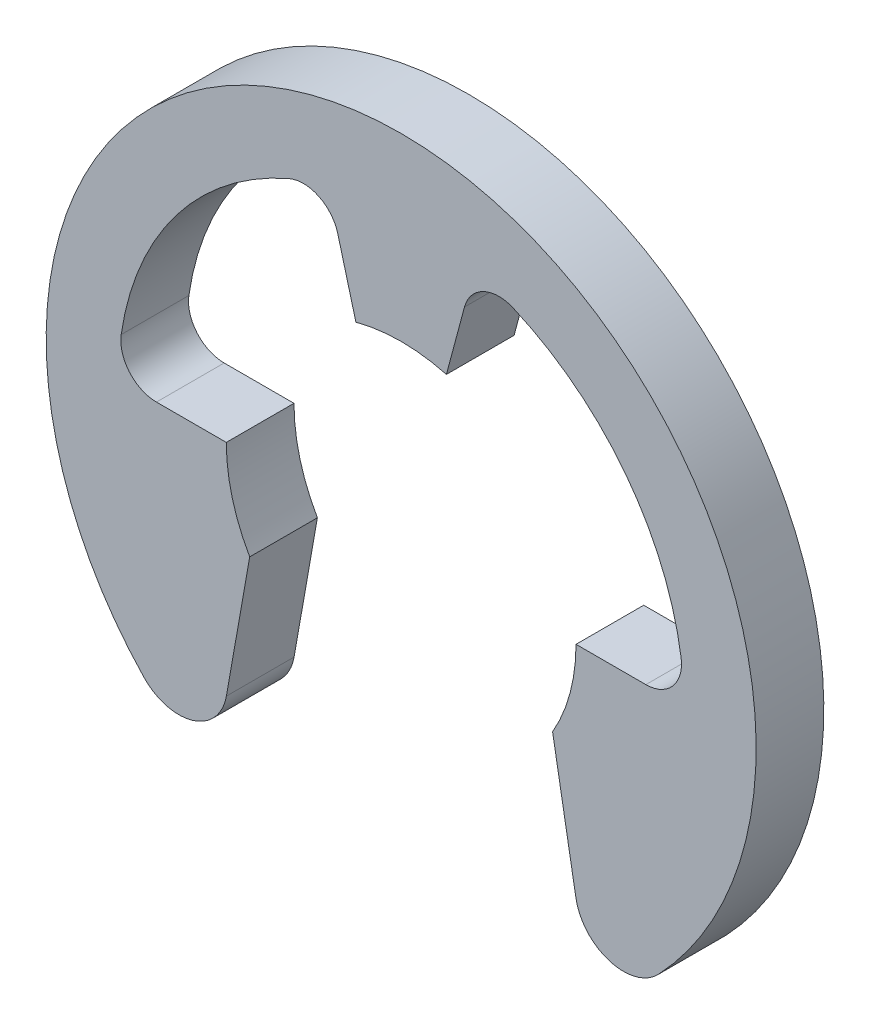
ISO-10303-21;
HEADER;
FILE_DESCRIPTION(('STEP AP214'),'2;1');
FILE_NAME('part.step','',(''),(''),'','','');
FILE_SCHEMA(('AUTOMOTIVE_DESIGN { 1 0 10303 214 1 1 1 1 }'));
ENDSEC;
DATA;
#1=APPLICATION_CONTEXT('core data for automotive mechanical design processes');
#2=APPLICATION_PROTOCOL_DEFINITION('international standard','automotive_design',2000,#1);
#3=PRODUCT_CONTEXT('',#1,'mechanical');
#4=PRODUCT('Part','Part','',(#3));
#5=PRODUCT_RELATED_PRODUCT_CATEGORY('part','',(#4));
#6=PRODUCT_DEFINITION_FORMATION('','',#4);
#7=PRODUCT_DEFINITION_CONTEXT('part definition',#1,'design');
#8=PRODUCT_DEFINITION('design','',#6,#7);
#9=PRODUCT_DEFINITION_SHAPE('','',#8);
#10=(LENGTH_UNIT() NAMED_UNIT(*) SI_UNIT(.MILLI.,.METRE.));
#11=(NAMED_UNIT(*) PLANE_ANGLE_UNIT() SI_UNIT($,.RADIAN.));
#12=(NAMED_UNIT(*) SI_UNIT($,.STERADIAN.) SOLID_ANGLE_UNIT());
#13=UNCERTAINTY_MEASURE_WITH_UNIT(LENGTH_MEASURE(1.E-05),#10,'distance_accuracy_value','');
#14=(GEOMETRIC_REPRESENTATION_CONTEXT(3) GLOBAL_UNCERTAINTY_ASSIGNED_CONTEXT((#13)) GLOBAL_UNIT_ASSIGNED_CONTEXT((#10,
#11,#12)) REPRESENTATION_CONTEXT('',''));
#15=CARTESIAN_POINT('',(0.,0.,0.));
#16=DIRECTION('',(0.,0.,1.));
#17=DIRECTION('',(1.,0.,0.));
#18=AXIS2_PLACEMENT_3D('',#15,#16,#17);
#19=CARTESIAN_POINT('',(2.16887826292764,0.316106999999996,-0.6));
#20=DIRECTION('',(0.,0.,1.));
#21=DIRECTION('',(1.,0.,0.));
#22=AXIS2_PLACEMENT_3D('',#19,#20,#21);
#23=CYLINDRICAL_SURFACE('',#22,0.316107);
#24=CARTESIAN_POINT('',(2.16887826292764,0.316106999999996,0.));
#25=DIRECTION('',(0.,0.,-1.));
#26=DIRECTION('',(1.,0.,0.));
#27=AXIS2_PLACEMENT_3D('',#24,#25,#26);
#28=CIRCLE('',#27,0.316107);
#29=CARTESIAN_POINT('',(2.48168043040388,0.361696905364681,0.));
#30=VERTEX_POINT('',#29);
#31=CARTESIAN_POINT('',(2.16887826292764,0.,0.));
#32=VERTEX_POINT('',#31);
#33=EDGE_CURVE('E157',#30,#32,#28,.T.);
#34=ORIENTED_EDGE('',*,*,#33,.F.);
#35=DIRECTION('',(0.,0.,1.));
#36=VECTOR('',#35,1.);
#37=CARTESIAN_POINT('',(2.48168043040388,0.361696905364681,-0.6));
#38=LINE('',#37,#36);
#39=CARTESIAN_POINT('',(2.48168043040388,0.361696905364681,-0.6));
#40=VERTEX_POINT('',#39);
#41=EDGE_CURVE('E11',#40,#30,#38,.T.);
#42=ORIENTED_EDGE('',*,*,#41,.F.);
#43=CARTESIAN_POINT('',(2.16887826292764,0.316106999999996,-0.6));
#44=DIRECTION('',(0.,0.,-1.));
#45=DIRECTION('',(1.,0.,0.));
#46=AXIS2_PLACEMENT_3D('',#43,#44,#45);
#47=CIRCLE('',#46,0.316107);
#48=CARTESIAN_POINT('',(2.16887826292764,0.,-0.6));
#49=VERTEX_POINT('',#48);
#50=EDGE_CURVE('E159',#40,#49,#47,.T.);
#51=ORIENTED_EDGE('',*,*,#50,.T.);
#52=DIRECTION('',(0.,0.,1.));
#53=VECTOR('',#52,1.);
#54=CARTESIAN_POINT('',(2.16887826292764,0.,-0.6));
#55=LINE('',#54,#53);
#56=EDGE_CURVE('E36',#49,#32,#55,.T.);
#57=ORIENTED_EDGE('',*,*,#56,.T.);
#58=EDGE_LOOP('',(#34,#42,#51,#57));
#59=FACE_BOUND('',#58,.T.);
#60=ADVANCED_FACE('F33',(#59),#23,.F.);
#61=CARTESIAN_POINT('',(0.,0.,-0.6));
#62=DIRECTION('',(0.,0.,1.));
#63=DIRECTION('',(1.,0.,0.));
#64=AXIS2_PLACEMENT_3D('',#61,#62,#63);
#65=CYLINDRICAL_SURFACE('',#64,2.5079);
#66=CARTESIAN_POINT('',(0.,0.,0.));
#67=DIRECTION('',(0.,0.,-1.));
#68=DIRECTION('',(1.,0.,0.));
#69=AXIS2_PLACEMENT_3D('',#66,#67,#68);
#70=CIRCLE('',#69,2.5079);
#71=CARTESIAN_POINT('',(0.991678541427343,2.30350517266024,0.));
#72=VERTEX_POINT('',#71);
#73=EDGE_CURVE('E175',#72,#30,#70,.T.);
#74=ORIENTED_EDGE('',*,*,#73,.F.);
#75=DIRECTION('',(0.,0.,1.));
#76=VECTOR('',#75,1.);
#77=CARTESIAN_POINT('',(0.991678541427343,2.30350517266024,-0.600000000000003));
#78=LINE('',#77,#76);
#79=CARTESIAN_POINT('',(0.991678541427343,2.30350517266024,-0.600000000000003));
#80=VERTEX_POINT('',#79);
#81=EDGE_CURVE('E41',#80,#72,#78,.T.);
#82=ORIENTED_EDGE('',*,*,#81,.F.);
#83=CARTESIAN_POINT('',(0.,0.,-0.6));
#84=DIRECTION('',(0.,0.,-1.));
#85=DIRECTION('',(1.,0.,0.));
#86=AXIS2_PLACEMENT_3D('',#83,#84,#85);
#87=CIRCLE('',#86,2.5079);
#88=EDGE_CURVE('E164',#80,#40,#87,.T.);
#89=ORIENTED_EDGE('',*,*,#88,.T.);
#90=ORIENTED_EDGE('',*,*,#41,.T.);
#91=EDGE_LOOP('',(#74,#82,#89,#90));
#92=FACE_BOUND('',#91,.T.);
#93=ADVANCED_FACE('F354',(#92),#65,.F.);
#94=CARTESIAN_POINT('',(0.866682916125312,2.01316101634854,-0.600000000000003));
#95=DIRECTION('',(0.,0.,1.));
#96=DIRECTION('',(1.,0.,0.));
#97=AXIS2_PLACEMENT_3D('',#94,#95,#96);
#98=CYLINDRICAL_SURFACE('',#97,0.316107);
#99=CARTESIAN_POINT('',(0.866682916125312,2.01316101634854,0.));
#100=DIRECTION('',(0.,0.,-1.));
#101=DIRECTION('',(1.,0.,0.));
#102=AXIS2_PLACEMENT_3D('',#99,#100,#101);
#103=CIRCLE('',#102,0.316107);
#104=CARTESIAN_POINT('',(0.561347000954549,2.09497552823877,0.));
#105=VERTEX_POINT('',#104);
#106=EDGE_CURVE('E218',#105,#72,#103,.T.);
#107=ORIENTED_EDGE('',*,*,#106,.F.);
#108=DIRECTION('',(0.,0.,1.));
#109=VECTOR('',#108,1.);
#110=CARTESIAN_POINT('',(0.561347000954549,2.09497552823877,-0.600000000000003));
#111=LINE('',#110,#109);
#112=CARTESIAN_POINT('',(0.561347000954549,2.09497552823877,-0.600000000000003));
#113=VERTEX_POINT('',#112);
#114=EDGE_CURVE('E270',#113,#105,#111,.T.);
#115=ORIENTED_EDGE('',*,*,#114,.F.);
#116=CARTESIAN_POINT('',(0.866682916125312,2.01316101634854,-0.600000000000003));
#117=DIRECTION('',(0.,0.,-1.));
#118=DIRECTION('',(1.,0.,0.));
#119=AXIS2_PLACEMENT_3D('',#116,#117,#118);
#120=CIRCLE('',#119,0.316107);
#121=EDGE_CURVE('E266',#113,#80,#120,.T.);
#122=ORIENTED_EDGE('',*,*,#121,.T.);
#123=ORIENTED_EDGE('',*,*,#81,.T.);
#124=EDGE_LOOP('',(#107,#115,#122,#123));
#125=FACE_BOUND('',#124,.T.);
#126=ADVANCED_FACE('F359',(#125),#98,.F.);
#127=CARTESIAN_POINT('',(0.401169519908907,1.49718503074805,-0.6));
#128=DIRECTION('',(0.965925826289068,-0.258819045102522,0.));
#129=DIRECTION('',(0.258819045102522,0.965925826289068,0.));
#130=AXIS2_PLACEMENT_3D('',#127,#128,#129);
#131=PLANE('',#130);
#132=DIRECTION('',(0.258819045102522,0.965925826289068,0.));
#133=VECTOR('',#132,1.);
#134=CARTESIAN_POINT('',(0.401169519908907,1.49718503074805,0.));
#135=LINE('',#134,#133);
#136=CARTESIAN_POINT('',(0.401169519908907,1.49718503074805,0.));
#137=VERTEX_POINT('',#136);
#138=EDGE_CURVE('E215',#137,#105,#135,.T.);
#139=ORIENTED_EDGE('',*,*,#138,.F.);
#140=DIRECTION('',(0.,0.,1.));
#141=VECTOR('',#140,1.);
#142=CARTESIAN_POINT('',(0.401169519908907,1.49718503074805,-0.6));
#143=LINE('',#142,#141);
#144=CARTESIAN_POINT('',(0.401169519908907,1.49718503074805,-0.6));
#145=VERTEX_POINT('',#144);
#146=EDGE_CURVE('E272',#145,#137,#143,.T.);
#147=ORIENTED_EDGE('',*,*,#146,.F.);
#148=DIRECTION('',(0.258819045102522,0.965925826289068,0.));
#149=VECTOR('',#148,1.);
#150=CARTESIAN_POINT('',(0.401169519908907,1.49718503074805,-0.6));
#151=LINE('',#150,#149);
#152=EDGE_CURVE('E263',#145,#113,#151,.T.);
#153=ORIENTED_EDGE('',*,*,#152,.T.);
#154=ORIENTED_EDGE('',*,*,#114,.T.);
#155=EDGE_LOOP('',(#139,#147,#153,#154));
#156=FACE_BOUND('',#155,.T.);
#157=ADVANCED_FACE('F351',(#156),#131,.T.);
#158=CARTESIAN_POINT('',(0.,0.,-0.6));
#159=DIRECTION('',(0.,0.,1.));
#160=DIRECTION('',(1.,0.,0.));
#161=AXIS2_PLACEMENT_3D('',#158,#159,#160);
#162=CYLINDRICAL_SURFACE('',#161,1.55);
#163=CARTESIAN_POINT('',(0.,0.,0.));
#164=DIRECTION('',(0.,0.,-1.));
#165=DIRECTION('',(-1.,0.,0.));
#166=AXIS2_PLACEMENT_3D('',#163,#164,#165);
#167=CIRCLE('',#166,1.55);
#168=CARTESIAN_POINT('',(-0.401169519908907,1.49718503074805,0.));
#169=VERTEX_POINT('',#168);
#170=EDGE_CURVE('E212',#169,#137,#167,.T.);
#171=ORIENTED_EDGE('',*,*,#170,.F.);
#172=DIRECTION('',(0.,0.,1.));
#173=VECTOR('',#172,1.);
#174=CARTESIAN_POINT('',(-0.401169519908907,1.49718503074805,-0.6));
#175=LINE('',#174,#173);
#176=CARTESIAN_POINT('',(-0.401169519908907,1.49718503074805,-0.6));
#177=VERTEX_POINT('',#176);
#178=EDGE_CURVE('E274',#177,#169,#175,.T.);
#179=ORIENTED_EDGE('',*,*,#178,.F.);
#180=CARTESIAN_POINT('',(0.,0.,-0.6));
#181=DIRECTION('',(0.,0.,-1.));
#182=DIRECTION('',(-1.,0.,0.));
#183=AXIS2_PLACEMENT_3D('',#180,#181,#182);
#184=CIRCLE('',#183,1.55);
#185=EDGE_CURVE('E260',#177,#145,#184,.T.);
#186=ORIENTED_EDGE('',*,*,#185,.T.);
#187=ORIENTED_EDGE('',*,*,#146,.T.);
#188=EDGE_LOOP('',(#171,#179,#186,#187));
#189=FACE_BOUND('',#188,.T.);
#190=ADVANCED_FACE('F347',(#189),#162,.F.);
#191=CARTESIAN_POINT('',(-0.401169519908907,1.49718503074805,-0.6));
#192=DIRECTION('',(-0.965925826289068,-0.258819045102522,0.));
#193=DIRECTION('',(0.258819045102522,-0.965925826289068,0.));
#194=AXIS2_PLACEMENT_3D('',#191,#192,#193);
#195=PLANE('',#194);
#196=DIRECTION('',(0.258819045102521,-0.965925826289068,0.));
#197=VECTOR('',#196,1.);
#198=CARTESIAN_POINT('',(-0.401169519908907,1.49718503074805,0.));
#199=LINE('',#198,#197);
#200=CARTESIAN_POINT('',(-0.561347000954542,2.09497552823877,0.));
#201=VERTEX_POINT('',#200);
#202=EDGE_CURVE('E209',#201,#169,#199,.T.);
#203=ORIENTED_EDGE('',*,*,#202,.F.);
#204=DIRECTION('',(0.,0.,1.));
#205=VECTOR('',#204,1.);
#206=CARTESIAN_POINT('',(-0.561347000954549,2.09497552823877,-0.600000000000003));
#207=LINE('',#206,#205);
#208=CARTESIAN_POINT('',(-0.561347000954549,2.09497552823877,-0.600000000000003));
#209=VERTEX_POINT('',#208);
#210=EDGE_CURVE('E276',#209,#201,#207,.T.);
#211=ORIENTED_EDGE('',*,*,#210,.F.);
#212=DIRECTION('',(0.258819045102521,-0.965925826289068,0.));
#213=VECTOR('',#212,1.);
#214=CARTESIAN_POINT('',(-0.401169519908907,1.49718503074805,-0.6));
#215=LINE('',#214,#213);
#216=EDGE_CURVE('E257',#209,#177,#215,.T.);
#217=ORIENTED_EDGE('',*,*,#216,.T.);
#218=ORIENTED_EDGE('',*,*,#178,.T.);
#219=EDGE_LOOP('',(#203,#211,#217,#218));
#220=FACE_BOUND('',#219,.T.);
#221=ADVANCED_FACE('F343',(#220),#195,.T.);
#222=CARTESIAN_POINT('',(-0.866682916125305,2.01316101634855,-0.600000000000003));
#223=DIRECTION('',(0.,0.,1.));
#224=DIRECTION('',(1.,0.,0.));
#225=AXIS2_PLACEMENT_3D('',#222,#223,#224);
#226=CYLINDRICAL_SURFACE('',#225,0.316107);
#227=CARTESIAN_POINT('',(-0.866682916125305,2.01316101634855,0.));
#228=DIRECTION('',(0.,0.,-1.));
#229=DIRECTION('',(1.,0.,0.));
#230=AXIS2_PLACEMENT_3D('',#227,#228,#229);
#231=CIRCLE('',#230,0.316107);
#232=CARTESIAN_POINT('',(-0.991678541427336,2.30350517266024,0.));
#233=VERTEX_POINT('',#232);
#234=EDGE_CURVE('E206',#233,#201,#231,.T.);
#235=ORIENTED_EDGE('',*,*,#234,.F.);
#236=DIRECTION('',(0.,0.,1.));
#237=VECTOR('',#236,1.);
#238=CARTESIAN_POINT('',(-0.991678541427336,2.30350517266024,-0.6));
#239=LINE('',#238,#237);
#240=CARTESIAN_POINT('',(-0.991678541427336,2.30350517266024,-0.6));
#241=VERTEX_POINT('',#240);
#242=EDGE_CURVE('E278',#241,#233,#239,.T.);
#243=ORIENTED_EDGE('',*,*,#242,.F.);
#244=CARTESIAN_POINT('',(-0.866682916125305,2.01316101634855,-0.600000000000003));
#245=DIRECTION('',(0.,0.,-1.));
#246=DIRECTION('',(1.,0.,0.));
#247=AXIS2_PLACEMENT_3D('',#244,#245,#246);
#248=CIRCLE('',#247,0.316107);
#249=EDGE_CURVE('E254',#241,#209,#248,.T.);
#250=ORIENTED_EDGE('',*,*,#249,.T.);
#251=ORIENTED_EDGE('',*,*,#210,.T.);
#252=EDGE_LOOP('',(#235,#243,#250,#251));
#253=FACE_BOUND('',#252,.T.);
#254=ADVANCED_FACE('F339',(#253),#226,.F.);
#255=CARTESIAN_POINT('',(0.,0.,-0.6));
#256=DIRECTION('',(0.,0.,1.));
#257=DIRECTION('',(1.,0.,0.));
#258=AXIS2_PLACEMENT_3D('',#255,#256,#257);
#259=CYLINDRICAL_SURFACE('',#258,2.5079);
#260=CARTESIAN_POINT('',(0.,0.,0.));
#261=DIRECTION('',(0.,0.,-1.));
#262=DIRECTION('',(1.,0.,0.));
#263=AXIS2_PLACEMENT_3D('',#260,#261,#262);
#264=CIRCLE('',#263,2.5079);
#265=CARTESIAN_POINT('',(-2.48168043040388,0.361696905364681,0.));
#266=VERTEX_POINT('',#265);
#267=EDGE_CURVE('E203',#266,#233,#264,.T.);
#268=ORIENTED_EDGE('',*,*,#267,.F.);
#269=DIRECTION('',(0.,0.,1.));
#270=VECTOR('',#269,1.);
#271=CARTESIAN_POINT('',(-2.48168043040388,0.361696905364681,-0.6));
#272=LINE('',#271,#270);
#273=CARTESIAN_POINT('',(-2.48168043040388,0.361696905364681,-0.6));
#274=VERTEX_POINT('',#273);
#275=EDGE_CURVE('E280',#274,#266,#272,.T.);
#276=ORIENTED_EDGE('',*,*,#275,.F.);
#277=CARTESIAN_POINT('',(0.,0.,-0.6));
#278=DIRECTION('',(0.,0.,-1.));
#279=DIRECTION('',(1.,0.,0.));
#280=AXIS2_PLACEMENT_3D('',#277,#278,#279);
#281=CIRCLE('',#280,2.5079);
#282=EDGE_CURVE('E251',#274,#241,#281,.T.);
#283=ORIENTED_EDGE('',*,*,#282,.T.);
#284=ORIENTED_EDGE('',*,*,#242,.T.);
#285=EDGE_LOOP('',(#268,#276,#283,#284));
#286=FACE_BOUND('',#285,.T.);
#287=ADVANCED_FACE('F335',(#286),#259,.F.);
#288=CARTESIAN_POINT('',(-2.16887826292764,0.316106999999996,-0.6));
#289=DIRECTION('',(0.,0.,1.));
#290=DIRECTION('',(1.,0.,0.));
#291=AXIS2_PLACEMENT_3D('',#288,#289,#290);
#292=CYLINDRICAL_SURFACE('',#291,0.316107);
#293=CARTESIAN_POINT('',(-2.16887826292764,0.316106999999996,0.));
#294=DIRECTION('',(0.,0.,-1.));
#295=DIRECTION('',(1.,0.,0.));
#296=AXIS2_PLACEMENT_3D('',#293,#294,#295);
#297=CIRCLE('',#296,0.316107);
#298=CARTESIAN_POINT('',(-2.16887826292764,0.,0.));
#299=VERTEX_POINT('',#298);
#300=EDGE_CURVE('E200',#299,#266,#297,.T.);
#301=ORIENTED_EDGE('',*,*,#300,.F.);
#302=DIRECTION('',(0.,0.,1.));
#303=VECTOR('',#302,1.);
#304=CARTESIAN_POINT('',(-2.16887826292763,0.,-0.6));
#305=LINE('',#304,#303);
#306=CARTESIAN_POINT('',(-2.16887826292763,0.,-0.6));
#307=VERTEX_POINT('',#306);
#308=EDGE_CURVE('E282',#307,#299,#305,.T.);
#309=ORIENTED_EDGE('',*,*,#308,.F.);
#310=CARTESIAN_POINT('',(-2.16887826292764,0.316106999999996,-0.6));
#311=DIRECTION('',(0.,0.,-1.));
#312=DIRECTION('',(1.,0.,0.));
#313=AXIS2_PLACEMENT_3D('',#310,#311,#312);
#314=CIRCLE('',#313,0.316107);
#315=EDGE_CURVE('E248',#307,#274,#314,.T.);
#316=ORIENTED_EDGE('',*,*,#315,.T.);
#317=ORIENTED_EDGE('',*,*,#275,.T.);
#318=EDGE_LOOP('',(#301,#309,#316,#317));
#319=FACE_BOUND('',#318,.T.);
#320=ADVANCED_FACE('F331',(#319),#292,.F.);
#321=CARTESIAN_POINT('',(-1.55,0.,-0.6));
#322=DIRECTION('',(0.,1.,0.));
#323=DIRECTION('',(-1.,0.,0.));
#324=AXIS2_PLACEMENT_3D('',#321,#322,#323);
#325=PLANE('',#324);
#326=DIRECTION('',(-1.,0.,0.));
#327=VECTOR('',#326,1.);
#328=CARTESIAN_POINT('',(-1.55,0.,0.));
#329=LINE('',#328,#327);
#330=CARTESIAN_POINT('',(-1.55,0.,0.));
#331=VERTEX_POINT('',#330);
#332=EDGE_CURVE('E197',#331,#299,#329,.T.);
#333=ORIENTED_EDGE('',*,*,#332,.F.);
#334=DIRECTION('',(0.,0.,1.));
#335=VECTOR('',#334,1.);
#336=CARTESIAN_POINT('',(-1.55,0.,-0.6));
#337=LINE('',#336,#335);
#338=CARTESIAN_POINT('',(-1.55,0.,-0.6));
#339=VERTEX_POINT('',#338);
#340=EDGE_CURVE('E284',#339,#331,#337,.T.);
#341=ORIENTED_EDGE('',*,*,#340,.F.);
#342=DIRECTION('',(-1.,0.,0.));
#343=VECTOR('',#342,1.);
#344=CARTESIAN_POINT('',(-1.55,0.,-0.6));
#345=LINE('',#344,#343);
#346=EDGE_CURVE('E245',#339,#307,#345,.T.);
#347=ORIENTED_EDGE('',*,*,#346,.T.);
#348=ORIENTED_EDGE('',*,*,#308,.T.);
#349=EDGE_LOOP('',(#333,#341,#347,#348));
#350=FACE_BOUND('',#349,.T.);
#351=ADVANCED_FACE('F327',(#350),#325,.T.);
#352=CARTESIAN_POINT('',(0.,0.,-0.6));
#353=DIRECTION('',(0.,0.,1.));
#354=DIRECTION('',(1.,0.,0.));
#355=AXIS2_PLACEMENT_3D('',#352,#353,#354);
#356=CYLINDRICAL_SURFACE('',#355,1.55);
#357=CARTESIAN_POINT('',(0.,0.,0.));
#358=DIRECTION('',(0.,0.,-1.));
#359=DIRECTION('',(1.,0.,0.));
#360=AXIS2_PLACEMENT_3D('',#357,#358,#359);
#361=CIRCLE('',#360,1.55);
#362=CARTESIAN_POINT('',(-1.34233937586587,-0.775000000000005,0.));
#363=VERTEX_POINT('',#362);
#364=EDGE_CURVE('E194',#363,#331,#361,.T.);
#365=ORIENTED_EDGE('',*,*,#364,.F.);
#366=DIRECTION('',(0.,0.,1.));
#367=VECTOR('',#366,1.);
#368=CARTESIAN_POINT('',(-1.34233937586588,-0.775000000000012,-0.6));
#369=LINE('',#368,#367);
#370=CARTESIAN_POINT('',(-1.34233937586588,-0.775000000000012,-0.6));
#371=VERTEX_POINT('',#370);
#372=EDGE_CURVE('E286',#371,#363,#369,.T.);
#373=ORIENTED_EDGE('',*,*,#372,.F.);
#374=CARTESIAN_POINT('',(0.,0.,-0.6));
#375=DIRECTION('',(0.,0.,-1.));
#376=DIRECTION('',(1.,0.,0.));
#377=AXIS2_PLACEMENT_3D('',#374,#375,#376);
#378=CIRCLE('',#377,1.55);
#379=EDGE_CURVE('E242',#371,#339,#378,.T.);
#380=ORIENTED_EDGE('',*,*,#379,.T.);
#381=ORIENTED_EDGE('',*,*,#340,.T.);
#382=EDGE_LOOP('',(#365,#373,#380,#381));
#383=FACE_BOUND('',#382,.T.);
#384=ADVANCED_FACE('F323',(#383),#356,.F.);
#385=CARTESIAN_POINT('',(-1.34233937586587,-0.775000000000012,-0.6));
#386=DIRECTION('',(0.984807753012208,-0.173648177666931,0.));
#387=DIRECTION('',(0.173648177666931,0.984807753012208,0.));
#388=AXIS2_PLACEMENT_3D('',#385,#386,#387);
#389=PLANE('',#388);
#390=DIRECTION('',(0.173648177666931,0.984807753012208,0.));
#391=VECTOR('',#390,1.);
#392=CARTESIAN_POINT('',(-1.34233937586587,-0.775000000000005,0.));
#393=LINE('',#392,#391);
#394=CARTESIAN_POINT('',(-1.54906104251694,-1.94737682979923,0.));
#395=VERTEX_POINT('',#394);
#396=EDGE_CURVE('E191',#395,#363,#393,.T.);
#397=ORIENTED_EDGE('',*,*,#396,.F.);
#398=DIRECTION('',(0.,0.,1.));
#399=VECTOR('',#398,1.);
#400=CARTESIAN_POINT('',(-1.54906104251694,-1.94737682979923,-0.600000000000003));
#401=LINE('',#400,#399);
#402=CARTESIAN_POINT('',(-1.54906104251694,-1.94737682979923,-0.600000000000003));
#403=VERTEX_POINT('',#402);
#404=EDGE_CURVE('E288',#403,#395,#401,.T.);
#405=ORIENTED_EDGE('',*,*,#404,.F.);
#406=DIRECTION('',(0.173648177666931,0.984807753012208,0.));
#407=VECTOR('',#406,1.);
#408=CARTESIAN_POINT('',(-1.34233937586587,-0.775000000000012,-0.6));
#409=LINE('',#408,#407);
#410=EDGE_CURVE('E239',#403,#371,#409,.T.);
#411=ORIENTED_EDGE('',*,*,#410,.T.);
#412=ORIENTED_EDGE('',*,*,#372,.T.);
#413=EDGE_LOOP('',(#397,#405,#411,#412));
#414=FACE_BOUND('',#413,.T.);
#415=ADVANCED_FACE('F319',(#414),#389,.T.);
#416=CARTESIAN_POINT('',(-1.97042285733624,-1.8730793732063,-0.600000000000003));
#417=DIRECTION('',(0.,0.,1.));
#418=DIRECTION('',(1.,0.,0.));
#419=AXIS2_PLACEMENT_3D('',#416,#417,#418);
#420=CYLINDRICAL_SURFACE('',#419,0.427862);
#421=CARTESIAN_POINT('',(-1.97042285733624,-1.8730793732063,0.));
#422=DIRECTION('',(0.,0.,1.));
#423=DIRECTION('',(1.,0.,0.));
#424=AXIS2_PLACEMENT_3D('',#421,#422,#423);
#425=CIRCLE('',#424,0.427862);
#426=CARTESIAN_POINT('',(-2.28053000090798,-2.16786650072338,0.));
#427=VERTEX_POINT('',#426);
#428=EDGE_CURVE('E188',#427,#395,#425,.T.);
#429=ORIENTED_EDGE('',*,*,#428,.F.);
#430=DIRECTION('',(0.,0.,1.));
#431=VECTOR('',#430,1.);
#432=CARTESIAN_POINT('',(-2.28053000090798,-2.16786650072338,-0.600000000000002));
#433=LINE('',#432,#431);
#434=CARTESIAN_POINT('',(-2.28053000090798,-2.16786650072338,-0.600000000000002));
#435=VERTEX_POINT('',#434);
#436=EDGE_CURVE('E290',#435,#427,#433,.T.);
#437=ORIENTED_EDGE('',*,*,#436,.F.);
#438=CARTESIAN_POINT('',(-1.97042285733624,-1.8730793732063,-0.600000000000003));
#439=DIRECTION('',(0.,0.,1.));
#440=DIRECTION('',(1.,0.,0.));
#441=AXIS2_PLACEMENT_3D('',#438,#439,#440);
#442=CIRCLE('',#441,0.427862);
#443=EDGE_CURVE('E236',#435,#403,#442,.T.);
#444=ORIENTED_EDGE('',*,*,#443,.T.);
#445=ORIENTED_EDGE('',*,*,#404,.T.);
#446=EDGE_LOOP('',(#429,#437,#444,#445));
#447=FACE_BOUND('',#446,.T.);
#448=ADVANCED_FACE('F315',(#447),#420,.T.);
#449=CARTESIAN_POINT('',(0.,0.,-0.6));
#450=DIRECTION('',(0.,0.,1.));
#451=DIRECTION('',(1.,0.,0.));
#452=AXIS2_PLACEMENT_3D('',#449,#450,#451);
#453=CYLINDRICAL_SURFACE('',#452,3.1465);
#454=CARTESIAN_POINT('',(0.,0.,0.));
#455=DIRECTION('',(0.,0.,1.));
#456=DIRECTION('',(1.,0.,0.));
#457=AXIS2_PLACEMENT_3D('',#454,#455,#456);
#458=CIRCLE('',#457,3.1465);
#459=CARTESIAN_POINT('',(2.28053000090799,-2.16786650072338,0.));
#460=VERTEX_POINT('',#459);
#461=EDGE_CURVE('E185',#460,#427,#458,.T.);
#462=ORIENTED_EDGE('',*,*,#461,.F.);
#463=DIRECTION('',(0.,0.,1.));
#464=VECTOR('',#463,1.);
#465=CARTESIAN_POINT('',(2.28053000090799,-2.16786650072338,-0.6));
#466=LINE('',#465,#464);
#467=CARTESIAN_POINT('',(2.28053000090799,-2.16786650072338,-0.6));
#468=VERTEX_POINT('',#467);
#469=EDGE_CURVE('E292',#468,#460,#466,.T.);
#470=ORIENTED_EDGE('',*,*,#469,.F.);
#471=CARTESIAN_POINT('',(0.,0.,-0.6));
#472=DIRECTION('',(0.,0.,1.));
#473=DIRECTION('',(1.,0.,0.));
#474=AXIS2_PLACEMENT_3D('',#471,#472,#473);
#475=CIRCLE('',#474,3.1465);
#476=EDGE_CURVE('E233',#468,#435,#475,.T.);
#477=ORIENTED_EDGE('',*,*,#476,.T.);
#478=ORIENTED_EDGE('',*,*,#436,.T.);
#479=EDGE_LOOP('',(#462,#470,#477,#478));
#480=FACE_BOUND('',#479,.T.);
#481=ADVANCED_FACE('F311',(#480),#453,.T.);
#482=CARTESIAN_POINT('',(1.97042285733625,-1.8730793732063,-0.600000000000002));
#483=DIRECTION('',(0.,0.,1.));
#484=DIRECTION('',(1.,0.,0.));
#485=AXIS2_PLACEMENT_3D('',#482,#483,#484);
#486=CYLINDRICAL_SURFACE('',#485,0.427862);
#487=CARTESIAN_POINT('',(1.97042285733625,-1.8730793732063,0.));
#488=DIRECTION('',(0.,0.,1.));
#489=DIRECTION('',(1.,0.,0.));
#490=AXIS2_PLACEMENT_3D('',#487,#488,#489);
#491=CIRCLE('',#490,0.427862);
#492=CARTESIAN_POINT('',(1.54906104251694,-1.94737682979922,0.));
#493=VERTEX_POINT('',#492);
#494=EDGE_CURVE('E182',#493,#460,#491,.T.);
#495=ORIENTED_EDGE('',*,*,#494,.F.);
#496=DIRECTION('',(0.,0.,1.));
#497=VECTOR('',#496,1.);
#498=CARTESIAN_POINT('',(1.54906104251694,-1.94737682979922,-0.600000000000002));
#499=LINE('',#498,#497);
#500=CARTESIAN_POINT('',(1.54906104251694,-1.94737682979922,-0.600000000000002));
#501=VERTEX_POINT('',#500);
#502=EDGE_CURVE('E294',#501,#493,#499,.T.);
#503=ORIENTED_EDGE('',*,*,#502,.F.);
#504=CARTESIAN_POINT('',(1.97042285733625,-1.8730793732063,-0.600000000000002));
#505=DIRECTION('',(0.,0.,1.));
#506=DIRECTION('',(1.,0.,0.));
#507=AXIS2_PLACEMENT_3D('',#504,#505,#506);
#508=CIRCLE('',#507,0.427862);
#509=EDGE_CURVE('E230',#501,#468,#508,.T.);
#510=ORIENTED_EDGE('',*,*,#509,.T.);
#511=ORIENTED_EDGE('',*,*,#469,.T.);
#512=EDGE_LOOP('',(#495,#503,#510,#511));
#513=FACE_BOUND('',#512,.T.);
#514=ADVANCED_FACE('F307',(#513),#486,.T.);
#515=CARTESIAN_POINT('',(1.34233937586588,-0.775000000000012,-0.6));
#516=DIRECTION('',(-0.984807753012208,-0.17364817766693,0.));
#517=DIRECTION('',(0.17364817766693,-0.984807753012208,0.));
#518=AXIS2_PLACEMENT_3D('',#515,#516,#517);
#519=PLANE('',#518);
#520=DIRECTION('',(0.17364817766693,-0.984807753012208,0.));
#521=VECTOR('',#520,1.);
#522=CARTESIAN_POINT('',(1.34233937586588,-0.775000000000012,0.));
#523=LINE('',#522,#521);
#524=CARTESIAN_POINT('',(1.34233937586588,-0.775000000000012,0.));
#525=VERTEX_POINT('',#524);
#526=EDGE_CURVE('E179',#525,#493,#523,.T.);
#527=ORIENTED_EDGE('',*,*,#526,.F.);
#528=DIRECTION('',(0.,0.,1.));
#529=VECTOR('',#528,1.);
#530=CARTESIAN_POINT('',(1.34233937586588,-0.775000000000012,-0.6));
#531=LINE('',#530,#529);
#532=CARTESIAN_POINT('',(1.34233937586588,-0.775000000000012,-0.6));
#533=VERTEX_POINT('',#532);
#534=EDGE_CURVE('E296',#533,#525,#531,.T.);
#535=ORIENTED_EDGE('',*,*,#534,.F.);
#536=DIRECTION('',(0.17364817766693,-0.984807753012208,0.));
#537=VECTOR('',#536,1.);
#538=CARTESIAN_POINT('',(1.34233937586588,-0.775000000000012,-0.6));
#539=LINE('',#538,#537);
#540=EDGE_CURVE('E227',#533,#501,#539,.T.);
#541=ORIENTED_EDGE('',*,*,#540,.T.);
#542=ORIENTED_EDGE('',*,*,#502,.T.);
#543=EDGE_LOOP('',(#527,#535,#541,#542));
#544=FACE_BOUND('',#543,.T.);
#545=ADVANCED_FACE('F303',(#544),#519,.T.);
#546=CARTESIAN_POINT('',(0.,0.,-0.6));
#547=DIRECTION('',(0.,0.,1.));
#548=DIRECTION('',(1.,0.,0.));
#549=AXIS2_PLACEMENT_3D('',#546,#547,#548);
#550=CYLINDRICAL_SURFACE('',#549,1.55);
#551=CARTESIAN_POINT('',(0.,0.,0.));
#552=DIRECTION('',(0.,0.,-1.));
#553=DIRECTION('',(1.,0.,0.));
#554=AXIS2_PLACEMENT_3D('',#551,#552,#553);
#555=CIRCLE('',#554,1.55);
#556=CARTESIAN_POINT('',(1.55000000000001,0.,0.));
#557=VERTEX_POINT('',#556);
#558=EDGE_CURVE('E171',#557,#525,#555,.T.);
#559=ORIENTED_EDGE('',*,*,#558,.F.);
#560=DIRECTION('',(0.,0.,1.));
#561=VECTOR('',#560,1.);
#562=CARTESIAN_POINT('',(1.55000000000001,0.,-0.6));
#563=LINE('',#562,#561);
#564=CARTESIAN_POINT('',(1.55000000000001,0.,-0.6));
#565=VERTEX_POINT('',#564);
#566=EDGE_CURVE('E163',#565,#557,#563,.T.);
#567=ORIENTED_EDGE('',*,*,#566,.F.);
#568=CARTESIAN_POINT('',(0.,0.,-0.6));
#569=DIRECTION('',(0.,0.,-1.));
#570=DIRECTION('',(1.,0.,0.));
#571=AXIS2_PLACEMENT_3D('',#568,#569,#570);
#572=CIRCLE('',#571,1.55);
#573=EDGE_CURVE('E224',#565,#533,#572,.T.);
#574=ORIENTED_EDGE('',*,*,#573,.T.);
#575=ORIENTED_EDGE('',*,*,#534,.T.);
#576=EDGE_LOOP('',(#559,#567,#574,#575));
#577=FACE_BOUND('',#576,.T.);
#578=ADVANCED_FACE('F299',(#577),#550,.F.);
#579=CARTESIAN_POINT('',(1.55000000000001,0.,-0.6));
#580=DIRECTION('',(0.,1.,0.));
#581=DIRECTION('',(0.,0.,1.));
#582=AXIS2_PLACEMENT_3D('',#579,#580,#581);
#583=PLANE('',#582);
#584=DIRECTION('',(-1.,0.,0.));
#585=VECTOR('',#584,1.);
#586=CARTESIAN_POINT('',(1.55000000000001,0.,0.));
#587=LINE('',#586,#585);
#588=EDGE_CURVE('E166',#32,#557,#587,.T.);
#589=ORIENTED_EDGE('',*,*,#588,.F.);
#590=ORIENTED_EDGE('',*,*,#56,.F.);
#591=DIRECTION('',(-1.,0.,0.));
#592=VECTOR('',#591,1.);
#593=CARTESIAN_POINT('',(1.55000000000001,0.,-0.6));
#594=LINE('',#593,#592);
#595=EDGE_CURVE('E222',#49,#565,#594,.T.);
#596=ORIENTED_EDGE('',*,*,#595,.T.);
#597=ORIENTED_EDGE('',*,*,#566,.T.);
#598=EDGE_LOOP('',(#589,#590,#596,#597));
#599=FACE_BOUND('',#598,.T.);
#600=ADVANCED_FACE('F167',(#599),#583,.T.);
#601=CARTESIAN_POINT('',(2.16887826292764,0.316106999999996,-0.6));
#602=DIRECTION('',(0.,0.,1.));
#603=DIRECTION('',(1.,0.,0.));
#604=AXIS2_PLACEMENT_3D('',#601,#602,#603);
#605=PLANE('',#604);
#606=ORIENTED_EDGE('',*,*,#50,.F.);
#607=ORIENTED_EDGE('',*,*,#88,.F.);
#608=ORIENTED_EDGE('',*,*,#121,.F.);
#609=ORIENTED_EDGE('',*,*,#152,.F.);
#610=ORIENTED_EDGE('',*,*,#185,.F.);
#611=ORIENTED_EDGE('',*,*,#216,.F.);
#612=ORIENTED_EDGE('',*,*,#249,.F.);
#613=ORIENTED_EDGE('',*,*,#282,.F.);
#614=ORIENTED_EDGE('',*,*,#315,.F.);
#615=ORIENTED_EDGE('',*,*,#346,.F.);
#616=ORIENTED_EDGE('',*,*,#379,.F.);
#617=ORIENTED_EDGE('',*,*,#410,.F.);
#618=ORIENTED_EDGE('',*,*,#443,.F.);
#619=ORIENTED_EDGE('',*,*,#476,.F.);
#620=ORIENTED_EDGE('',*,*,#509,.F.);
#621=ORIENTED_EDGE('',*,*,#540,.F.);
#622=ORIENTED_EDGE('',*,*,#573,.F.);
#623=ORIENTED_EDGE('',*,*,#595,.F.);
#624=EDGE_LOOP('',(#606,#607,#608,#609,#610,#611,#612,#613,#614,#615,#616,#617,#618,#619,#620,
#621,#622,#623));
#625=FACE_BOUND('',#624,.T.);
#626=ADVANCED_FACE('F358',(#625),#605,.F.);
#627=CARTESIAN_POINT('',(2.16887826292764,0.316106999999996,0.));
#628=DIRECTION('',(0.,0.,1.));
#629=DIRECTION('',(1.,0.,0.));
#630=AXIS2_PLACEMENT_3D('',#627,#628,#629);
#631=PLANE('',#630);
#632=ORIENTED_EDGE('',*,*,#33,.T.);
#633=ORIENTED_EDGE('',*,*,#588,.T.);
#634=ORIENTED_EDGE('',*,*,#558,.T.);
#635=ORIENTED_EDGE('',*,*,#526,.T.);
#636=ORIENTED_EDGE('',*,*,#494,.T.);
#637=ORIENTED_EDGE('',*,*,#461,.T.);
#638=ORIENTED_EDGE('',*,*,#428,.T.);
#639=ORIENTED_EDGE('',*,*,#396,.T.);
#640=ORIENTED_EDGE('',*,*,#364,.T.);
#641=ORIENTED_EDGE('',*,*,#332,.T.);
#642=ORIENTED_EDGE('',*,*,#300,.T.);
#643=ORIENTED_EDGE('',*,*,#267,.T.);
#644=ORIENTED_EDGE('',*,*,#234,.T.);
#645=ORIENTED_EDGE('',*,*,#202,.T.);
#646=ORIENTED_EDGE('',*,*,#170,.T.);
#647=ORIENTED_EDGE('',*,*,#138,.T.);
#648=ORIENTED_EDGE('',*,*,#106,.T.);
#649=ORIENTED_EDGE('',*,*,#73,.T.);
#650=EDGE_LOOP('',(#632,#633,#634,#635,#636,#637,#638,#639,#640,#641,#642,#643,#644,#645,#646,
#647,#648,#649));
#651=FACE_BOUND('',#650,.T.);
#652=ADVANCED_FACE('F173',(#651),#631,.T.);
#653=CLOSED_SHELL('',(#60,#93,#126,#157,#190,#221,#254,#287,#320,#351,#384,#415,#448,#481,#514,
#545,#578,#600,#626,#652));
#654=MANIFOLD_SOLID_BREP('B2',#653);
#655=ADVANCED_BREP_SHAPE_REPRESENTATION('',(#18,#654),#14);
#656=SHAPE_DEFINITION_REPRESENTATION(#9,#655);
ENDSEC;
END-ISO-10303-21;
